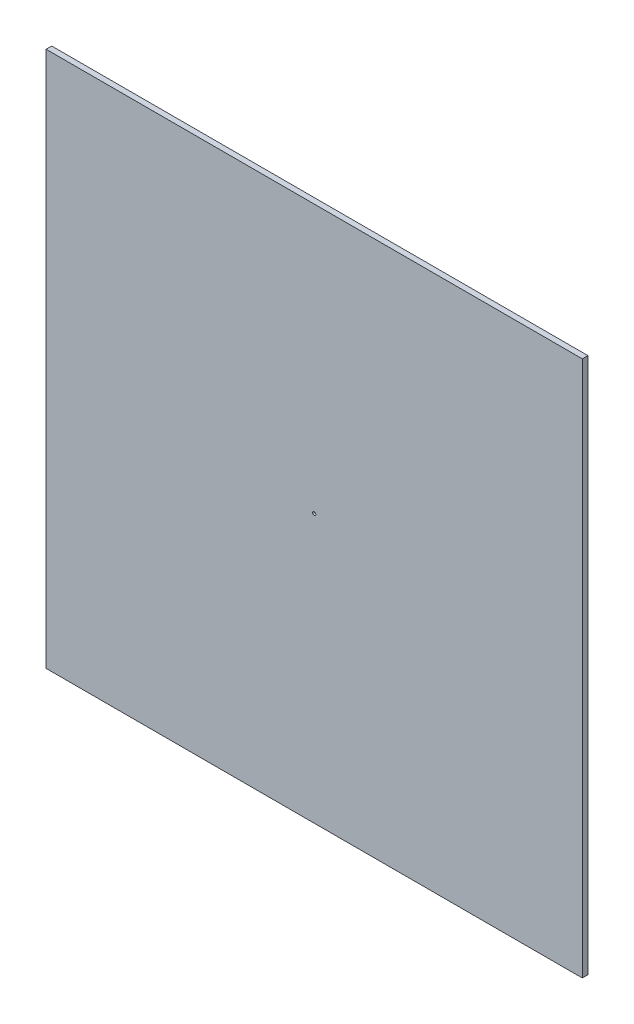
from build123d import *

# Parameters (mm, degrees)
SKETCH1_W           = 266.7
SKETCH1_H           = 266.7
BOSS_EXTRUDE1_DEPTH = 2.794
SKETCH2_R           = 0.79375
CUT_EXTRUDE1_DEPTH  = 378.181105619


with BuildPart() as part:
    # Sketch1 → Boss-Extrude1 (new body)
    with BuildSketch(Plane.XY):
        with Locations((133.35, -133.35)):
            Rectangle(SKETCH1_W, SKETCH1_H)
    extrude(amount=BOSS_EXTRUDE1_DEPTH)

    # Sketch2 → Cut-Extrude1 (cut, through all)
    with BuildSketch(Plane.XY.offset(2.794)):
        with Locations((133.35, -133.35)):
            Circle(SKETCH2_R)
    extrude(amount=-CUT_EXTRUDE1_DEPTH, mode=Mode.SUBTRACT)


solid = part.part
